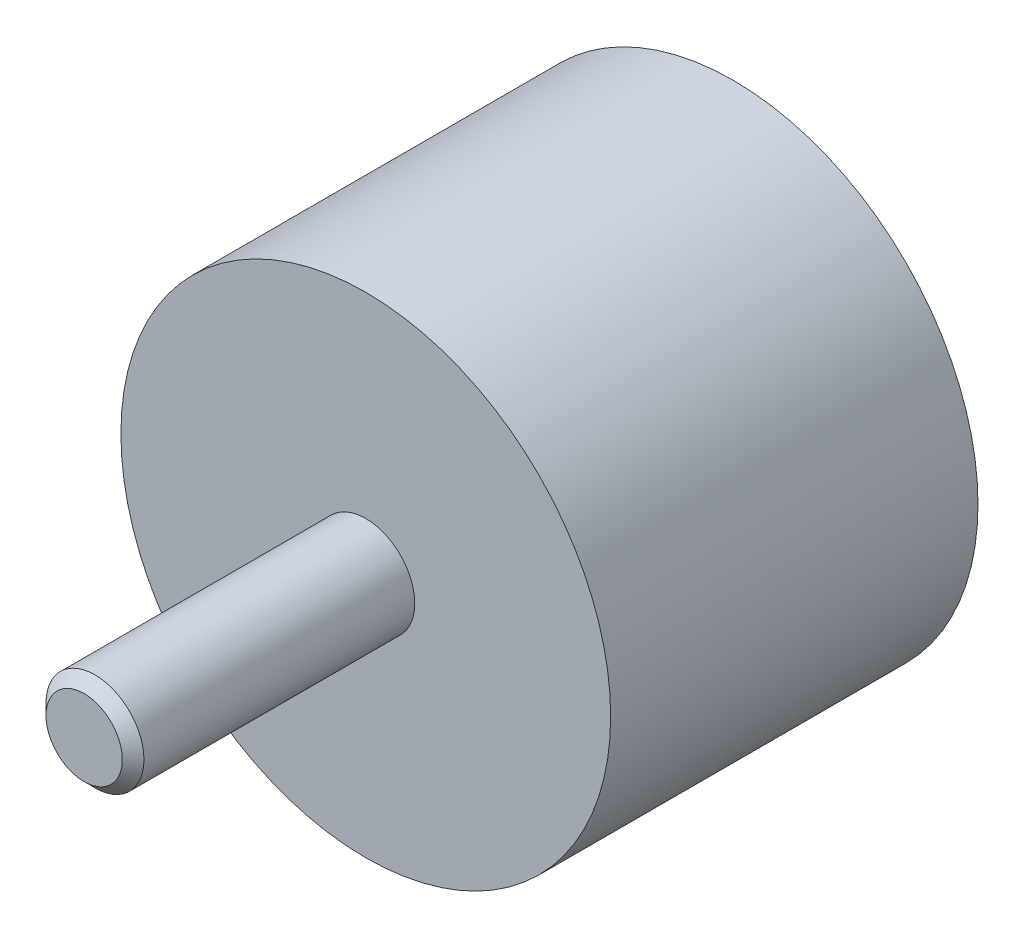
ISO-10303-21;
HEADER;
FILE_DESCRIPTION(('STEP AP214'),'2;1');
FILE_NAME('part.step','',(''),(''),'','','');
FILE_SCHEMA(('AUTOMOTIVE_DESIGN { 1 0 10303 214 1 1 1 1 }'));
ENDSEC;
DATA;
#1=APPLICATION_CONTEXT('core data for automotive mechanical design processes');
#2=APPLICATION_PROTOCOL_DEFINITION('international standard','automotive_design',2000,#1);
#3=PRODUCT_CONTEXT('',#1,'mechanical');
#4=PRODUCT('Part','Part','',(#3));
#5=PRODUCT_RELATED_PRODUCT_CATEGORY('part','',(#4));
#6=PRODUCT_DEFINITION_FORMATION('','',#4);
#7=PRODUCT_DEFINITION_CONTEXT('part definition',#1,'design');
#8=PRODUCT_DEFINITION('design','',#6,#7);
#9=PRODUCT_DEFINITION_SHAPE('','',#8);
#10=(LENGTH_UNIT() NAMED_UNIT(*) SI_UNIT(.MILLI.,.METRE.));
#11=(NAMED_UNIT(*) PLANE_ANGLE_UNIT() SI_UNIT($,.RADIAN.));
#12=(NAMED_UNIT(*) SI_UNIT($,.STERADIAN.) SOLID_ANGLE_UNIT());
#13=UNCERTAINTY_MEASURE_WITH_UNIT(LENGTH_MEASURE(1.E-05),#10,'distance_accuracy_value','');
#14=(GEOMETRIC_REPRESENTATION_CONTEXT(3) GLOBAL_UNCERTAINTY_ASSIGNED_CONTEXT((#13)) GLOBAL_UNIT_ASSIGNED_CONTEXT((#10,
#11,#12)) REPRESENTATION_CONTEXT('',''));
#15=CARTESIAN_POINT('',(0.,0.,0.));
#16=DIRECTION('',(0.,0.,1.));
#17=DIRECTION('',(1.,0.,0.));
#18=AXIS2_PLACEMENT_3D('',#15,#16,#17);
#19=CARTESIAN_POINT('',(0.,0.,0.66666666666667));
#20=DIRECTION('',(0.,0.,1.));
#21=DIRECTION('',(0.,-1.,0.));
#22=AXIS2_PLACEMENT_3D('',#19,#20,#21);
#23=CYLINDRICAL_SURFACE('',#22,20.);
#24=CARTESIAN_POINT('',(0.,0.,0.));
#25=DIRECTION('',(0.,0.,1.));
#26=DIRECTION('',(0.,-1.,0.));
#27=AXIS2_PLACEMENT_3D('',#24,#25,#26);
#28=CIRCLE('',#27,20.);
#29=CARTESIAN_POINT('',(0.,-20.,0.));
#30=VERTEX_POINT('',#29);
#31=EDGE_CURVE('E27',#30,#30,#28,.T.);
#32=ORIENTED_EDGE('',*,*,#31,.T.);
#33=EDGE_LOOP('',(#32));
#34=FACE_BOUND('',#33,.T.);
#35=CARTESIAN_POINT('',(0.,0.,30.));
#36=DIRECTION('',(0.,0.,-1.));
#37=DIRECTION('',(-1.,0.,0.));
#38=AXIS2_PLACEMENT_3D('',#35,#36,#37);
#39=CIRCLE('',#38,20.);
#40=CARTESIAN_POINT('',(-20.,0.,30.));
#41=VERTEX_POINT('',#40);
#42=EDGE_CURVE('E35',#41,#41,#39,.T.);
#43=ORIENTED_EDGE('',*,*,#42,.T.);
#44=EDGE_LOOP('',(#43));
#45=FACE_BOUND('',#44,.T.);
#46=ADVANCED_FACE('F12',(#34,#45),#23,.T.);
#47=CARTESIAN_POINT('',(20.,0.,0.));
#48=DIRECTION('',(0.,0.,-1.));
#49=DIRECTION('',(0.,1.,0.));
#50=AXIS2_PLACEMENT_3D('',#47,#48,#49);
#51=PLANE('',#50);
#52=CARTESIAN_POINT('',(0.,0.,0.));
#53=DIRECTION('',(0.,0.,-1.));
#54=DIRECTION('',(0.,1.,0.));
#55=AXIS2_PLACEMENT_3D('',#52,#53,#54);
#56=CIRCLE('',#55,4.5);
#57=CARTESIAN_POINT('',(0.,4.5,0.));
#58=VERTEX_POINT('',#57);
#59=EDGE_CURVE('E19',#58,#58,#56,.F.);
#60=ORIENTED_EDGE('',*,*,#59,.T.);
#61=EDGE_LOOP('',(#60));
#62=FACE_BOUND('',#61,.T.);
#63=ORIENTED_EDGE('',*,*,#31,.F.);
#64=EDGE_LOOP('',(#63));
#65=FACE_BOUND('',#64,.T.);
#66=ADVANCED_FACE('F58',(#62,#65),#51,.T.);
#67=CARTESIAN_POINT('',(0.,0.,0.));
#68=DIRECTION('',(0.,0.,1.));
#69=DIRECTION('',(0.,-1.,0.));
#70=AXIS2_PLACEMENT_3D('',#67,#68,#69);
#71=CYLINDRICAL_SURFACE('',#70,4.);
#72=CARTESIAN_POINT('',(0.,0.,0.499999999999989));
#73=DIRECTION('',(0.,0.,-1.));
#74=DIRECTION('',(0.,1.,0.));
#75=AXIS2_PLACEMENT_3D('',#72,#73,#74);
#76=CIRCLE('',#75,4.);
#77=CARTESIAN_POINT('',(0.,4.,0.499999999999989));
#78=VERTEX_POINT('',#77);
#79=EDGE_CURVE('E23',#78,#78,#76,.T.);
#80=ORIENTED_EDGE('',*,*,#79,.T.);
#81=EDGE_LOOP('',(#80));
#82=FACE_BOUND('',#81,.T.);
#83=CARTESIAN_POINT('',(0.,0.,8.));
#84=DIRECTION('',(0.,0.,-1.));
#85=DIRECTION('',(0.,1.,0.));
#86=AXIS2_PLACEMENT_3D('',#83,#84,#85);
#87=CIRCLE('',#86,4.);
#88=CARTESIAN_POINT('',(0.,4.,8.));
#89=VERTEX_POINT('',#88);
#90=EDGE_CURVE('E32',#89,#89,#87,.T.);
#91=ORIENTED_EDGE('',*,*,#90,.F.);
#92=EDGE_LOOP('',(#91));
#93=FACE_BOUND('',#92,.T.);
#94=ADVANCED_FACE('F63',(#82,#93),#71,.F.);
#95=CARTESIAN_POINT('',(0.,0.,8.));
#96=DIRECTION('',(0.,0.,-1.));
#97=DIRECTION('',(0.,1.,0.));
#98=AXIS2_PLACEMENT_3D('',#95,#96,#97);
#99=PLANE('',#98);
#100=ORIENTED_EDGE('',*,*,#90,.T.);
#101=EDGE_LOOP('',(#100));
#102=FACE_BOUND('',#101,.T.);
#103=ADVANCED_FACE('F69',(#102),#99,.T.);
#104=CARTESIAN_POINT('',(0.,0.,0.499999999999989));
#105=DIRECTION('',(0.,0.,-1.));
#106=DIRECTION('',(0.,1.,0.));
#107=AXIS2_PLACEMENT_3D('',#104,#105,#106);
#108=CONICAL_SURFACE('',#107,4.,0.785398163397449);
#109=ORIENTED_EDGE('',*,*,#59,.F.);
#110=EDGE_LOOP('',(#109));
#111=FACE_BOUND('',#110,.T.);
#112=ORIENTED_EDGE('',*,*,#79,.F.);
#113=EDGE_LOOP('',(#112));
#114=FACE_BOUND('',#113,.T.);
#115=ADVANCED_FACE('F14',(#111,#114),#108,.F.);
#116=CARTESIAN_POINT('',(0.,20.,30.));
#117=DIRECTION('',(0.,0.,1.));
#118=DIRECTION('',(1.,0.,0.));
#119=AXIS2_PLACEMENT_3D('',#116,#117,#118);
#120=PLANE('',#119);
#121=CARTESIAN_POINT('',(0.,0.,30.));
#122=DIRECTION('',(0.,0.,1.));
#123=DIRECTION('',(1.,0.,0.));
#124=AXIS2_PLACEMENT_3D('',#121,#122,#123);
#125=CIRCLE('',#124,4.);
#126=CARTESIAN_POINT('',(4.,0.,30.));
#127=VERTEX_POINT('',#126);
#128=EDGE_CURVE('E8',#127,#127,#125,.F.);
#129=ORIENTED_EDGE('',*,*,#128,.T.);
#130=EDGE_LOOP('',(#129));
#131=FACE_BOUND('',#130,.T.);
#132=ORIENTED_EDGE('',*,*,#42,.F.);
#133=EDGE_LOOP('',(#132));
#134=FACE_BOUND('',#133,.T.);
#135=ADVANCED_FACE('F73',(#131,#134),#120,.T.);
#136=CARTESIAN_POINT('',(0.,0.,20.));
#137=DIRECTION('',(0.,0.,1.));
#138=DIRECTION('',(0.,-1.,0.));
#139=AXIS2_PLACEMENT_3D('',#136,#137,#138);
#140=CYLINDRICAL_SURFACE('',#139,4.);
#141=ORIENTED_EDGE('',*,*,#128,.F.);
#142=EDGE_LOOP('',(#141));
#143=FACE_BOUND('',#142,.T.);
#144=CARTESIAN_POINT('',(0.,0.,52.1163103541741));
#145=DIRECTION('',(0.,0.,-1.));
#146=DIRECTION('',(-1.,0.,0.));
#147=AXIS2_PLACEMENT_3D('',#144,#145,#146);
#148=CIRCLE('',#147,4.);
#149=CARTESIAN_POINT('',(-4.,0.,52.1163103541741));
#150=VERTEX_POINT('',#149);
#151=EDGE_CURVE('E38',#150,#150,#148,.T.);
#152=ORIENTED_EDGE('',*,*,#151,.T.);
#153=EDGE_LOOP('',(#152));
#154=FACE_BOUND('',#153,.T.);
#155=ADVANCED_FACE('F55',(#143,#154),#140,.T.);
#156=CARTESIAN_POINT('',(0.,0.,52.1163103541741));
#157=DIRECTION('',(0.,0.,-1.));
#158=DIRECTION('',(-1.,0.,0.));
#159=AXIS2_PLACEMENT_3D('',#156,#157,#158);
#160=CONICAL_SURFACE('',#159,4.,0.785398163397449);
#161=CARTESIAN_POINT('',(0.,0.,53.));
#162=DIRECTION('',(0.,0.,-1.));
#163=DIRECTION('',(-1.,0.,0.));
#164=AXIS2_PLACEMENT_3D('',#161,#162,#163);
#165=CIRCLE('',#164,3.11631035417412);
#166=CARTESIAN_POINT('',(-3.11631035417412,0.,53.));
#167=VERTEX_POINT('',#166);
#168=EDGE_CURVE('E41',#167,#167,#165,.T.);
#169=ORIENTED_EDGE('',*,*,#168,.T.);
#170=EDGE_LOOP('',(#169));
#171=FACE_BOUND('',#170,.T.);
#172=ORIENTED_EDGE('',*,*,#151,.F.);
#173=EDGE_LOOP('',(#172));
#174=FACE_BOUND('',#173,.T.);
#175=ADVANCED_FACE('F45',(#171,#174),#160,.T.);
#176=CARTESIAN_POINT('',(0.,3.11631035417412,53.));
#177=DIRECTION('',(0.,0.,1.));
#178=DIRECTION('',(1.,0.,0.));
#179=AXIS2_PLACEMENT_3D('',#176,#177,#178);
#180=PLANE('',#179);
#181=ORIENTED_EDGE('',*,*,#168,.F.);
#182=EDGE_LOOP('',(#181));
#183=FACE_BOUND('',#182,.T.);
#184=ADVANCED_FACE('F48',(#183),#180,.T.);
#185=CLOSED_SHELL('',(#46,#66,#94,#103,#115,#135,#155,#175,#184));
#186=MANIFOLD_SOLID_BREP('B1',#185);
#187=ADVANCED_BREP_SHAPE_REPRESENTATION('',(#18,#186),#14);
#188=SHAPE_DEFINITION_REPRESENTATION(#9,#187);
ENDSEC;
END-ISO-10303-21;
